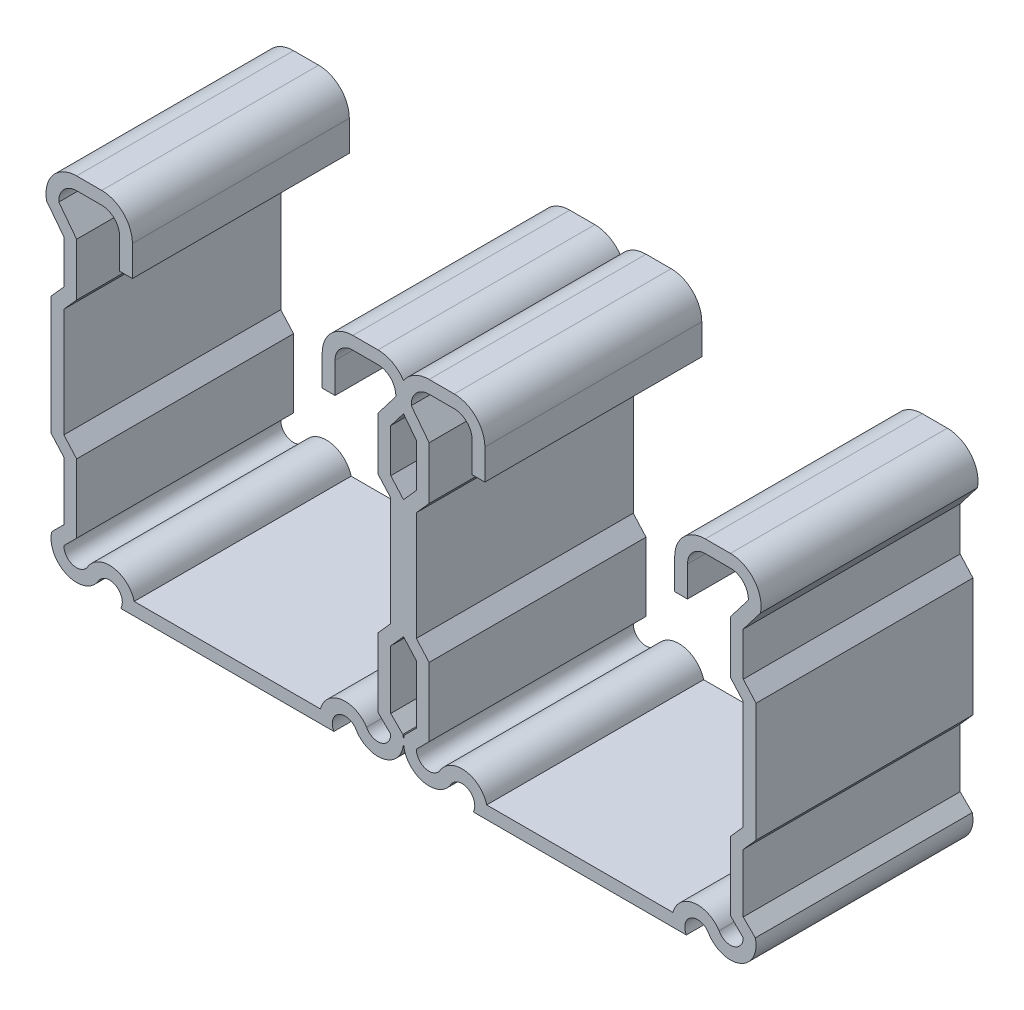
from build123d import *

# Parameters (mm, degrees)
BASE_EXTRUDE_DEPTH = 12.7
LPATTERN2_COUNT    = 2
LPATTERN2_PITCH    = 41.27246


with BuildPart() as part:
    # Sketch1 → Base-Extrude (new, symmetric)
    with BuildSketch(Plane.XY):
        with BuildLine():
            Line((17.6403, 16.339286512), (19.729882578, 19.063533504))
            ThreePointArc((19.729882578, 19.063533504), (19.156045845, 20.609744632), (17.6403, 21.2598))
            Line((17.6403, 21.2598), (14.70327367, 21.2598))
            ThreePointArc((14.70327367, 21.2598), (13.223883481, 20.647016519), (12.6111, 19.16762633))
            Line((12.6111, 19.16762633), (12.6111, 15.61465))
            Line((12.6111, 15.61465), (11.1125, 15.61465))
            Line((11.1125, 15.61465), (11.1125, 19.16762633))
            ThreePointArc((11.1125, 19.16762633), (12.164213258, 21.706686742), (14.70327367, 22.7584))
            Line((14.70327367, 22.7584), (17.6403, 22.7584))
            ThreePointArc((17.6403, 22.7584), (20.415434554, 21.446284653), (21.162428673, 18.4688666))
            Line((21.162428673, 18.4688666), (19.1389, 15.830735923))
            Line((19.1389, 15.830735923), (19.1389, 10.749129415))
            Line((19.1389, 10.749129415), (20.6375, 9.0662125))
            Line((20.6375, 9.0662125), (20.6375, -4.8244125))
            Line((20.6375, -4.8244125), (19.1389, -6.507329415))
            Line((19.1389, -6.507329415), (19.1389, -13.358784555))
            Line((19.1389, -13.358784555), (20.553458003, -14.773342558))
            ThreePointArc((20.553458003, -14.773342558), (18.729942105, -18.270236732), (15.019825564, -16.932883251))
            ThreePointArc((15.019825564, -16.932883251), (13.000752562, -16.523120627), (12.480559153, -18.5166))
            Line((12.480559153, -18.5166), (-12.480559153, -18.5166))
            ThreePointArc((-12.480559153, -18.5166), (-13.000752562, -16.523120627), (-15.019825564, -16.932883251))
            ThreePointArc((-15.019825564, -16.932883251), (-18.729942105, -18.270236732), (-20.553458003, -14.773342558))
            Line((-20.553458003, -14.773342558), (-19.1389, -13.358784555))
            Line((-19.1389, -13.358784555), (-19.1389, -6.507329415))
            Line((-19.1389, -6.507329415), (-20.6375, -4.8244125))
            Line((-20.6375, -4.8244125), (-20.6375, 9.0662125))
            Line((-20.6375, 9.0662125), (-19.1389, 10.749129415))
            Line((-19.1389, 10.749129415), (-19.1389, 15.830735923))
            Line((-19.1389, 15.830735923), (-21.162428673, 18.4688666))
            ThreePointArc((-21.162428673, 18.4688666), (-20.415434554, 21.446284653), (-17.6403, 22.7584))
            Line((-17.6403, 22.7584), (-14.70327367, 22.7584))
            ThreePointArc((-14.70327367, 22.7584), (-12.164213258, 21.706686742), (-11.1125, 19.16762633))
            Line((-11.1125, 19.16762633), (-11.1125, 15.61465))
            Line((-11.1125, 15.61465), (-12.6111, 15.61465))
            Line((-12.6111, 15.61465), (-12.6111, 19.16762633))
            ThreePointArc((-12.6111, 19.16762633), (-13.223883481, 20.647016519), (-14.70327367, 21.2598))
            Line((-14.70327367, 21.2598), (-17.6403, 21.2598))
            ThreePointArc((-17.6403, 21.2598), (-19.156045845, 20.609744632), (-19.729882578, 19.063533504))
            Line((-19.729882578, 19.063533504), (-17.6403, 16.339286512))
            Line((-17.6403, 16.339286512), (-17.6403, 10.17860201))
            Line((-17.6403, 10.17860201), (-19.1389, 8.495685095))
            Line((-19.1389, 8.495685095), (-19.1389, -4.253885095))
            Line((-19.1389, -4.253885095), (-17.6403, -5.93680201))
            Line((-17.6403, -5.93680201), (-17.6403, -13.979525))
            Line((-17.6403, -13.979525), (-19.1389, -15.478125))
            ThreePointArc((-19.1389, -15.478125), (-18.092238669, -16.906954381), (-16.414285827, -16.33992034))
            ThreePointArc((-16.414285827, -16.33992034), (-13.428073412, -14.819877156), (-10.898992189, -17.018))
            Line((-10.898992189, -17.018), (10.898992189, -17.018))
            ThreePointArc((10.898992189, -17.018), (13.323359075, -14.834630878), (16.30518861, -16.15877141))
            ThreePointArc((16.30518861, -16.15877141), (17.990302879, -16.935279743), (19.1389, -15.478125))
            Line((19.1389, -15.478125), (17.6403, -13.979525))
            Line((17.6403, -13.979525), (17.6403, -5.93680201))
            Line((17.6403, -5.93680201), (19.1389, -4.253885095))
            Line((19.1389, -4.253885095), (19.1389, 8.495685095))
            Line((19.1389, 8.495685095), (17.6403, 10.17860201))
            Line((17.6403, 10.17860201), (17.6403, 16.339286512))
        make_face()
    base_extrude = extrude(amount=BASE_EXTRUDE_DEPTH, both=True)

    # LPattern2: Base-Extrude ×2
    with Locations(*[(i * LPATTERN2_PITCH, 0, 0) for i in range(1, LPATTERN2_COUNT)]):
        add(base_extrude)


solid = part.part
